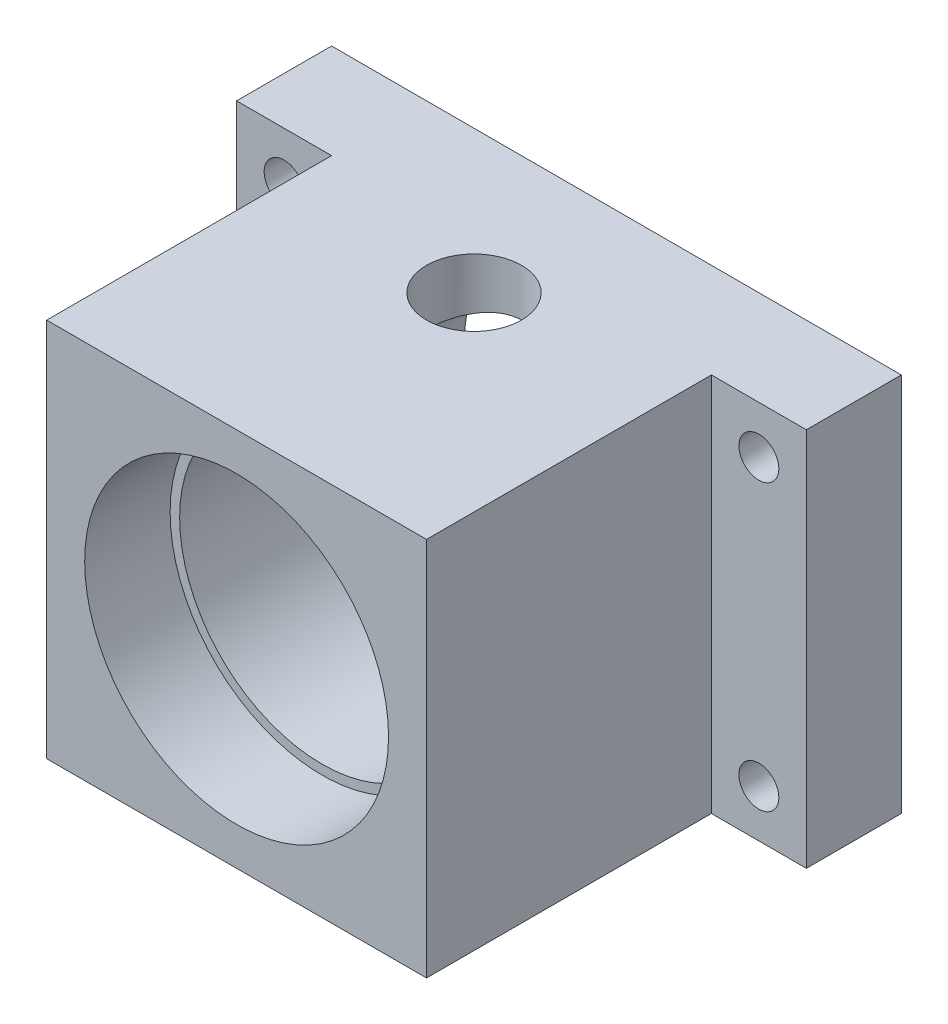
from build123d import *

# Parameters (mm, degrees)
SKETCH_1_W               = 60
SKETCH_1_H               = 40
SKETCH_1_R               = 15
SKETCH_1_R_2             = 2.1
EXTRUDE_1_DEPTH          = 40
SKETCH_2_OUTSIDE_W       = 78.492
SKETCH_2_OUTSIDE_H       = 58.492
CUT_EXTRUDE_1_DEPTH      = 40
CUT_EXTRUDE_2_REACH      = 84.462
CUT_EXTRUDE_2_END_RADIUS = 15
SKETCH_3_R               = 5
SKETCH_4_R               = 16
CUT_EXTRUDE_3_DEPTH      = 9
CUT_EXTRUDE_START        = -9
SKETCH_5_R               = 16
CUT_EXTRUDE_4_DEPTH      = 9


with BuildPart() as part:
    # Sketch 1 → Extrude 1 (new body)
    with BuildSketch(Plane.XY):
        with Locations((30, 20)):
            Rectangle(SKETCH_1_W, SKETCH_1_H)
        with Locations((30, 20)):
            Circle(SKETCH_1_R, mode=Mode.SUBTRACT)
        with Locations((5, 35)):
            Circle(SKETCH_1_R_2, mode=Mode.SUBTRACT)
        with Locations((5, 5)):
            Circle(SKETCH_1_R_2, mode=Mode.SUBTRACT)
        with Locations((55, 5)):
            Circle(SKETCH_1_R_2, mode=Mode.SUBTRACT)
        with Locations((55, 35)):
            Circle(SKETCH_1_R_2, mode=Mode.SUBTRACT)
    extrude(amount=EXTRUDE_1_DEPTH)

    # Sketch 2 outside → Cut-Extrude 1 (cut)
    with BuildSketch(Plane(origin=(0, 40, 0), x_dir=(1, 0, 0), z_dir=(0, 1, 0))):
        with Locations((30, -20)):
            Rectangle(SKETCH_2_OUTSIDE_W, SKETCH_2_OUTSIDE_H)
        Polygon((50, -10), (60, -10), (60, 0), (0, 0), (0, -10), (10, -10), (10, -40), (50, -40), align=None, mode=Mode.SUBTRACT)
    extrude(amount=-CUT_EXTRUDE_1_DEPTH, mode=Mode.SUBTRACT)

    # Cut-Extrude 2: up to this cylinder (the profile starts outside it)
    cut_extrude_2_end = Plane(origin=(30, 20, 15), z_dir=(0, 0, -1)) * Cylinder(CUT_EXTRUDE_2_END_RADIUS, 199.924, mode=Mode.PRIVATE)
    # Sketch 3 → Cut-Extrude 2 (cut, up to the surface)
    with BuildSketch(Plane(origin=(0, 40, 0), x_dir=(1, 0, 0), z_dir=(0, 1, 0)), mode=Mode.PRIVATE) as cut_extrude_2_sk1:
        with Locations(Location((30, -15, 0), (0, 0, 270))):
            Circle(SKETCH_3_R)
    cut_extrude_2_tool1 = extrude(cut_extrude_2_sk1.sketch, amount=-CUT_EXTRUDE_2_REACH, mode=Mode.PRIVATE) - cut_extrude_2_end
    add(cut_extrude_2_tool1.solids().sort_by_distance((30, 40, 15))[0], mode=Mode.SUBTRACT)

    # Sketch 4 → Cut-Extrude 3 (cut)
    with BuildSketch(Plane.XY.offset(40)):
        with Locations((30, 20)):
            Circle(SKETCH_4_R)
    extrude(amount=-CUT_EXTRUDE_3_DEPTH, mode=Mode.SUBTRACT)

    # Sketch 5 → Cut-Extrude 4 (cut)
    with BuildSketch(Plane(origin=(0, 0, 0), x_dir=(-1, 0, 0), z_dir=(0, 0, -1)).offset(CUT_EXTRUDE_START)):
        with Locations(Location((-30, 20, 0), (0, 0, 180))):
            Circle(SKETCH_5_R)
    extrude(amount=CUT_EXTRUDE_4_DEPTH, mode=Mode.SUBTRACT)


solid = part.part
